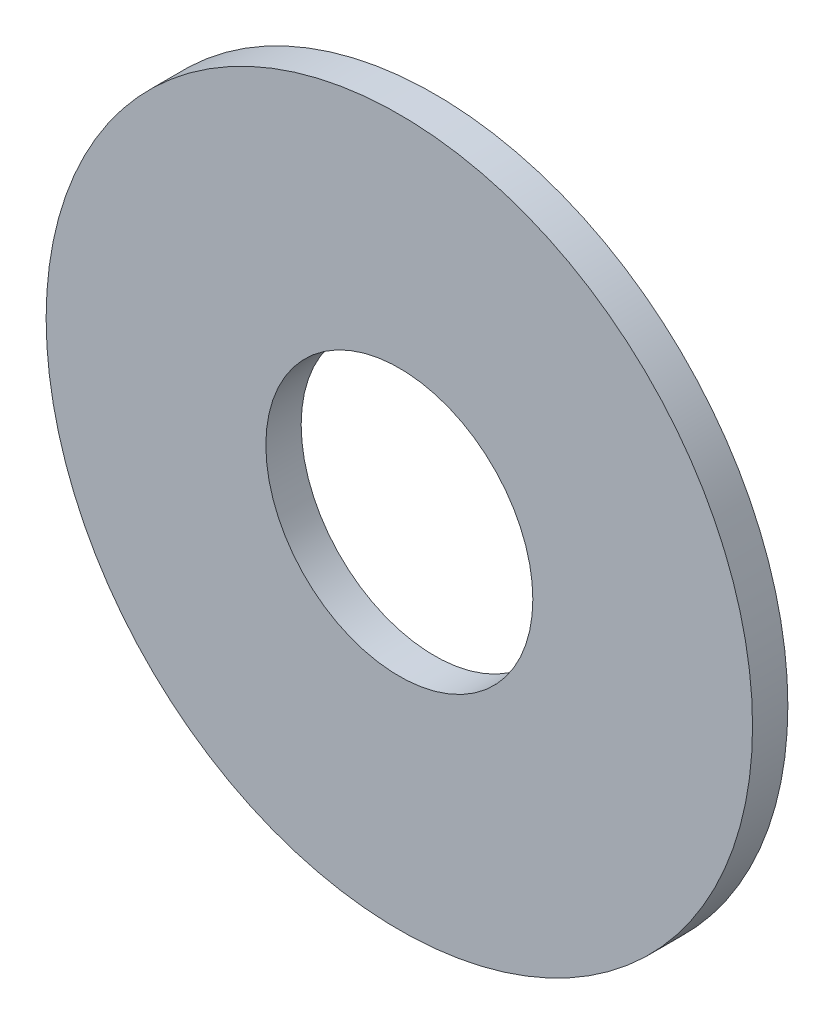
from build123d import *

# Parameters (mm, degrees)
ESQUISSE1_R      = 35
ESQUISSE1_R_2    = 13.227940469
EXTRUSION1_DEPTH = 3.5


with BuildPart() as part:
    # Esquisse1 → Extrusion1 (new body)
    with BuildSketch(Plane.XY):
        Circle(ESQUISSE1_R)
        Circle(ESQUISSE1_R_2, mode=Mode.SUBTRACT)
    extrude(amount=EXTRUSION1_DEPTH)


solid = part.part
